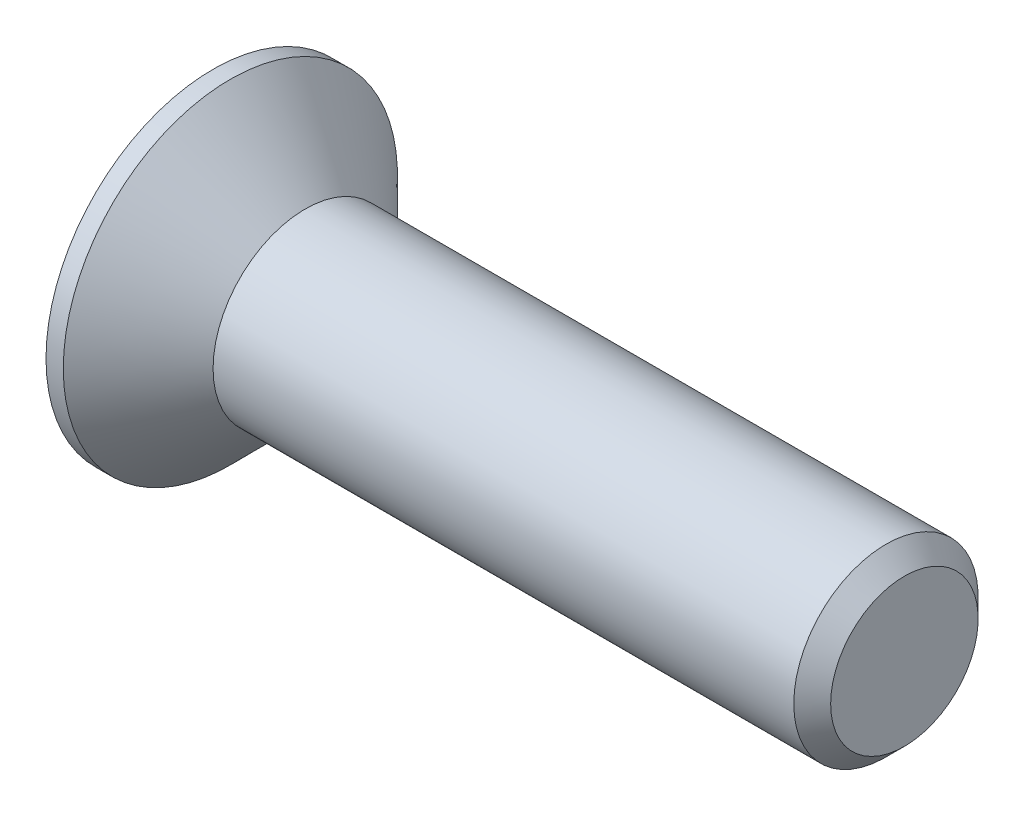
ISO-10303-21;
HEADER;
FILE_DESCRIPTION(('STEP AP214'),'2;1');
FILE_NAME('part.step','',(''),(''),'','','');
FILE_SCHEMA(('AUTOMOTIVE_DESIGN { 1 0 10303 214 1 1 1 1 }'));
ENDSEC;
DATA;
#1=APPLICATION_CONTEXT('core data for automotive mechanical design processes');
#2=APPLICATION_PROTOCOL_DEFINITION('international standard','automotive_design',2000,#1);
#3=PRODUCT_CONTEXT('',#1,'mechanical');
#4=PRODUCT('Part','Part','',(#3));
#5=PRODUCT_RELATED_PRODUCT_CATEGORY('part','',(#4));
#6=PRODUCT_DEFINITION_FORMATION('','',#4);
#7=PRODUCT_DEFINITION_CONTEXT('part definition',#1,'design');
#8=PRODUCT_DEFINITION('design','',#6,#7);
#9=PRODUCT_DEFINITION_SHAPE('','',#8);
#10=(LENGTH_UNIT() NAMED_UNIT(*) SI_UNIT(.MILLI.,.METRE.));
#11=(NAMED_UNIT(*) PLANE_ANGLE_UNIT() SI_UNIT($,.RADIAN.));
#12=(NAMED_UNIT(*) SI_UNIT($,.STERADIAN.) SOLID_ANGLE_UNIT());
#13=UNCERTAINTY_MEASURE_WITH_UNIT(LENGTH_MEASURE(1.E-05),#10,'distance_accuracy_value','');
#14=(GEOMETRIC_REPRESENTATION_CONTEXT(3) GLOBAL_UNCERTAINTY_ASSIGNED_CONTEXT((#13)) GLOBAL_UNIT_ASSIGNED_CONTEXT((#10,
#11,#12)) REPRESENTATION_CONTEXT('',''));
#15=CARTESIAN_POINT('',(0.,0.,0.));
#16=DIRECTION('',(0.,0.,1.));
#17=DIRECTION('',(1.,0.,0.));
#18=AXIS2_PLACEMENT_3D('',#15,#16,#17);
#19=CARTESIAN_POINT('',(0.,0.,0.));
#20=DIRECTION('',(-1.,0.,0.));
#21=DIRECTION('',(0.,0.,1.));
#22=AXIS2_PLACEMENT_3D('',#19,#20,#21);
#23=CONICAL_SURFACE('',#22,4.,0.78539816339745);
#24=CARTESIAN_POINT('',(-3.24999999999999,0.,0.));
#25=DIRECTION('',(-1.,0.,0.));
#26=DIRECTION('',(0.,0.,1.));
#27=AXIS2_PLACEMENT_3D('',#24,#25,#26);
#28=CIRCLE('',#27,7.25);
#29=CARTESIAN_POINT('',(-3.24999999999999,0.,7.25));
#30=VERTEX_POINT('',#29);
#31=EDGE_CURVE('E189',#30,#30,#28,.T.);
#32=ORIENTED_EDGE('',*,*,#31,.F.);
#33=EDGE_LOOP('',(#32));
#34=FACE_BOUND('',#33,.T.);
#35=CARTESIAN_POINT('',(0.,0.,0.));
#36=DIRECTION('',(-1.,0.,0.));
#37=DIRECTION('',(0.,0.,1.));
#38=AXIS2_PLACEMENT_3D('',#35,#36,#37);
#39=CIRCLE('',#38,4.);
#40=CARTESIAN_POINT('',(0.,0.,4.));
#41=VERTEX_POINT('',#40);
#42=EDGE_CURVE('E212',#41,#41,#39,.T.);
#43=ORIENTED_EDGE('',*,*,#42,.T.);
#44=EDGE_LOOP('',(#43));
#45=FACE_BOUND('',#44,.T.);
#46=ADVANCED_FACE('F33',(#34,#45),#23,.T.);
#47=CARTESIAN_POINT('',(-4.,0.,0.));
#48=DIRECTION('',(-1.,0.,0.));
#49=DIRECTION('',(0.,0.,1.));
#50=AXIS2_PLACEMENT_3D('',#47,#48,#49);
#51=CYLINDRICAL_SURFACE('',#50,4.);
#52=CARTESIAN_POINT('',(25.2,0.,0.));
#53=DIRECTION('',(-1.,0.,0.));
#54=DIRECTION('',(0.,0.,1.));
#55=AXIS2_PLACEMENT_3D('',#52,#53,#54);
#56=CIRCLE('',#55,4.);
#57=CARTESIAN_POINT('',(25.2,0.,4.));
#58=VERTEX_POINT('',#57);
#59=EDGE_CURVE('E41',#58,#58,#56,.T.);
#60=ORIENTED_EDGE('',*,*,#59,.T.);
#61=EDGE_LOOP('',(#60));
#62=FACE_BOUND('',#61,.T.);
#63=ORIENTED_EDGE('',*,*,#42,.F.);
#64=EDGE_LOOP('',(#63));
#65=FACE_BOUND('',#64,.T.);
#66=ADVANCED_FACE('F217',(#62,#65),#51,.T.);
#67=CARTESIAN_POINT('',(26.,0.,0.));
#68=DIRECTION('',(-1.,0.,0.));
#69=DIRECTION('',(0.,0.,1.));
#70=AXIS2_PLACEMENT_3D('',#67,#68,#69);
#71=PLANE('',#70);
#72=CARTESIAN_POINT('',(26.,0.,0.));
#73=DIRECTION('',(-1.,0.,0.));
#74=DIRECTION('',(0.,0.,1.));
#75=AXIS2_PLACEMENT_3D('',#72,#73,#74);
#76=CIRCLE('',#75,3.20000000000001);
#77=CARTESIAN_POINT('',(26.,0.,3.20000000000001));
#78=VERTEX_POINT('',#77);
#79=EDGE_CURVE('E11',#78,#78,#76,.F.);
#80=ORIENTED_EDGE('',*,*,#79,.T.);
#81=EDGE_LOOP('',(#80));
#82=FACE_BOUND('',#81,.T.);
#83=ADVANCED_FACE('F239',(#82),#71,.F.);
#84=CARTESIAN_POINT('',(-4.,7.25,0.));
#85=DIRECTION('',(1.,0.,0.));
#86=DIRECTION('',(0.,0.,-1.));
#87=AXIS2_PLACEMENT_3D('',#84,#85,#86);
#88=PLANE('',#87);
#89=DIRECTION('',(0.,0.,-1.));
#90=VECTOR('',#89,1.);
#91=CARTESIAN_POINT('',(-4.,1.09,-4.35));
#92=LINE('',#91,#90);
#93=CARTESIAN_POINT('',(-4.,1.09,-1.09));
#94=VERTEX_POINT('',#93);
#95=CARTESIAN_POINT('',(-4.,1.09,-4.35));
#96=VERTEX_POINT('',#95);
#97=EDGE_CURVE('E158',#94,#96,#92,.T.);
#98=ORIENTED_EDGE('',*,*,#97,.F.);
#99=DIRECTION('',(0.,-1.,0.));
#100=VECTOR('',#99,1.);
#101=CARTESIAN_POINT('',(-4.,1.09,-1.09));
#102=LINE('',#101,#100);
#103=CARTESIAN_POINT('',(-4.,4.35,-1.09));
#104=VERTEX_POINT('',#103);
#105=EDGE_CURVE('E48',#104,#94,#102,.T.);
#106=ORIENTED_EDGE('',*,*,#105,.F.);
#107=DIRECTION('',(0.,0.,-1.));
#108=VECTOR('',#107,1.);
#109=CARTESIAN_POINT('',(-4.,4.35,-1.09));
#110=LINE('',#109,#108);
#111=CARTESIAN_POINT('',(-4.,4.35,1.09));
#112=VERTEX_POINT('',#111);
#113=EDGE_CURVE('E185',#112,#104,#110,.T.);
#114=ORIENTED_EDGE('',*,*,#113,.F.);
#115=DIRECTION('',(0.,1.,0.));
#116=VECTOR('',#115,1.);
#117=CARTESIAN_POINT('',(-4.,4.35,1.09));
#118=LINE('',#117,#116);
#119=CARTESIAN_POINT('',(-4.,1.09,1.09));
#120=VERTEX_POINT('',#119);
#121=EDGE_CURVE('E183',#120,#112,#118,.T.);
#122=ORIENTED_EDGE('',*,*,#121,.F.);
#123=DIRECTION('',(0.,0.,-1.));
#124=VECTOR('',#123,1.);
#125=CARTESIAN_POINT('',(-4.,1.09,1.09));
#126=LINE('',#125,#124);
#127=CARTESIAN_POINT('',(-4.,1.09,4.35));
#128=VERTEX_POINT('',#127);
#129=EDGE_CURVE('E132',#128,#120,#126,.T.);
#130=ORIENTED_EDGE('',*,*,#129,.F.);
#131=DIRECTION('',(0.,1.,0.));
#132=VECTOR('',#131,1.);
#133=CARTESIAN_POINT('',(-4.,1.09,4.35));
#134=LINE('',#133,#132);
#135=CARTESIAN_POINT('',(-4.,-1.09,4.35));
#136=VERTEX_POINT('',#135);
#137=EDGE_CURVE('E179',#136,#128,#134,.T.);
#138=ORIENTED_EDGE('',*,*,#137,.F.);
#139=DIRECTION('',(0.,0.,1.));
#140=VECTOR('',#139,1.);
#141=CARTESIAN_POINT('',(-4.,-1.09,4.35));
#142=LINE('',#141,#140);
#143=CARTESIAN_POINT('',(-4.,-1.09,1.09));
#144=VERTEX_POINT('',#143);
#145=EDGE_CURVE('E176',#144,#136,#142,.T.);
#146=ORIENTED_EDGE('',*,*,#145,.F.);
#147=DIRECTION('',(0.,1.,0.));
#148=VECTOR('',#147,1.);
#149=CARTESIAN_POINT('',(-4.,-1.09,1.09));
#150=LINE('',#149,#148);
#151=CARTESIAN_POINT('',(-4.,-4.35,1.09));
#152=VERTEX_POINT('',#151);
#153=EDGE_CURVE('E173',#152,#144,#150,.T.);
#154=ORIENTED_EDGE('',*,*,#153,.F.);
#155=DIRECTION('',(0.,0.,1.));
#156=VECTOR('',#155,1.);
#157=CARTESIAN_POINT('',(-4.,-4.35,1.09));
#158=LINE('',#157,#156);
#159=CARTESIAN_POINT('',(-4.,-4.35,-1.09));
#160=VERTEX_POINT('',#159);
#161=EDGE_CURVE('E170',#160,#152,#158,.T.);
#162=ORIENTED_EDGE('',*,*,#161,.F.);
#163=DIRECTION('',(0.,-1.,0.));
#164=VECTOR('',#163,1.);
#165=CARTESIAN_POINT('',(-4.,-4.35,-1.09));
#166=LINE('',#165,#164);
#167=CARTESIAN_POINT('',(-4.,-1.09,-1.09));
#168=VERTEX_POINT('',#167);
#169=EDGE_CURVE('E167',#168,#160,#166,.T.);
#170=ORIENTED_EDGE('',*,*,#169,.F.);
#171=DIRECTION('',(0.,0.,1.));
#172=VECTOR('',#171,1.);
#173=CARTESIAN_POINT('',(-4.,-1.09,-1.09));
#174=LINE('',#173,#172);
#175=CARTESIAN_POINT('',(-4.,-1.09,-4.35));
#176=VERTEX_POINT('',#175);
#177=EDGE_CURVE('E164',#176,#168,#174,.T.);
#178=ORIENTED_EDGE('',*,*,#177,.F.);
#179=DIRECTION('',(0.,-1.,0.));
#180=VECTOR('',#179,1.);
#181=CARTESIAN_POINT('',(-4.,-1.09,-4.35));
#182=LINE('',#181,#180);
#183=EDGE_CURVE('E161',#96,#176,#182,.T.);
#184=ORIENTED_EDGE('',*,*,#183,.F.);
#185=EDGE_LOOP('',(#98,#106,#114,#122,#130,#138,#146,#154,#162,#170,#178,#184));
#186=FACE_BOUND('',#185,.T.);
#187=CARTESIAN_POINT('',(-4.,0.,0.));
#188=DIRECTION('',(-1.,0.,0.));
#189=DIRECTION('',(0.,0.,1.));
#190=AXIS2_PLACEMENT_3D('',#187,#188,#189);
#191=CIRCLE('',#190,7.25);
#192=CARTESIAN_POINT('',(-4.,0.,7.25));
#193=VERTEX_POINT('',#192);
#194=EDGE_CURVE('E209',#193,#193,#191,.T.);
#195=ORIENTED_EDGE('',*,*,#194,.T.);
#196=EDGE_LOOP('',(#195));
#197=FACE_BOUND('',#196,.T.);
#198=ADVANCED_FACE('F230',(#186,#197),#88,.F.);
#199=CARTESIAN_POINT('',(-4.,0.,0.));
#200=DIRECTION('',(-1.,0.,0.));
#201=DIRECTION('',(0.,0.,1.));
#202=AXIS2_PLACEMENT_3D('',#199,#200,#201);
#203=CYLINDRICAL_SURFACE('',#202,7.25);
#204=ORIENTED_EDGE('',*,*,#194,.F.);
#205=EDGE_LOOP('',(#204));
#206=FACE_BOUND('',#205,.T.);
#207=ORIENTED_EDGE('',*,*,#31,.T.);
#208=EDGE_LOOP('',(#207));
#209=FACE_BOUND('',#208,.T.);
#210=ADVANCED_FACE('F222',(#206,#209),#203,.T.);
#211=CARTESIAN_POINT('',(25.2,0.,0.));
#212=DIRECTION('',(-1.,0.,0.));
#213=DIRECTION('',(0.,0.,1.));
#214=AXIS2_PLACEMENT_3D('',#211,#212,#213);
#215=CONICAL_SURFACE('',#214,4.,0.785398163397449);
#216=ORIENTED_EDGE('',*,*,#79,.F.);
#217=EDGE_LOOP('',(#216));
#218=FACE_BOUND('',#217,.T.);
#219=ORIENTED_EDGE('',*,*,#59,.F.);
#220=EDGE_LOOP('',(#219));
#221=FACE_BOUND('',#220,.T.);
#222=ADVANCED_FACE('F35',(#218,#221),#215,.T.);
#223=CARTESIAN_POINT('',(-0.55,1.09,-1.09));
#224=DIRECTION('',(0.,0.,-1.));
#225=DIRECTION('',(-1.,0.,0.));
#226=AXIS2_PLACEMENT_3D('',#223,#224,#225);
#227=PLANE('',#226);
#228=ORIENTED_EDGE('',*,*,#105,.T.);
#229=DIRECTION('',(-1.,0.,0.));
#230=VECTOR('',#229,1.);
#231=CARTESIAN_POINT('',(-0.55,1.09,-1.09));
#232=LINE('',#231,#230);
#233=CARTESIAN_POINT('',(-0.55,1.09,-1.09));
#234=VERTEX_POINT('',#233);
#235=EDGE_CURVE('E96',#234,#94,#232,.T.);
#236=ORIENTED_EDGE('',*,*,#235,.F.);
#237=DIRECTION('',(0.,-1.,0.));
#238=VECTOR('',#237,1.);
#239=CARTESIAN_POINT('',(-0.55,1.09,-1.09));
#240=LINE('',#239,#238);
#241=CARTESIAN_POINT('',(-0.55,4.35,-1.09));
#242=VERTEX_POINT('',#241);
#243=EDGE_CURVE('E187',#242,#234,#240,.T.);
#244=ORIENTED_EDGE('',*,*,#243,.F.);
#245=DIRECTION('',(-1.,0.,0.));
#246=VECTOR('',#245,1.);
#247=CARTESIAN_POINT('',(-0.55,4.35,-1.09));
#248=LINE('',#247,#246);
#249=EDGE_CURVE('E56',#242,#104,#248,.T.);
#250=ORIENTED_EDGE('',*,*,#249,.T.);
#251=EDGE_LOOP('',(#228,#236,#244,#250));
#252=FACE_BOUND('',#251,.T.);
#253=ADVANCED_FACE('F221',(#252),#227,.F.);
#254=CARTESIAN_POINT('',(-0.55,4.35,-1.09));
#255=DIRECTION('',(0.,1.,0.));
#256=DIRECTION('',(-1.,0.,0.));
#257=AXIS2_PLACEMENT_3D('',#254,#255,#256);
#258=PLANE('',#257);
#259=ORIENTED_EDGE('',*,*,#113,.T.);
#260=ORIENTED_EDGE('',*,*,#249,.F.);
#261=DIRECTION('',(0.,0.,-1.));
#262=VECTOR('',#261,1.);
#263=CARTESIAN_POINT('',(-0.55,4.35,-1.09));
#264=LINE('',#263,#262);
#265=CARTESIAN_POINT('',(-0.55,4.35,1.09));
#266=VERTEX_POINT('',#265);
#267=EDGE_CURVE('E144',#266,#242,#264,.T.);
#268=ORIENTED_EDGE('',*,*,#267,.F.);
#269=DIRECTION('',(-1.,0.,0.));
#270=VECTOR('',#269,1.);
#271=CARTESIAN_POINT('',(-0.55,4.35,1.09));
#272=LINE('',#271,#270);
#273=EDGE_CURVE('E136',#266,#112,#272,.T.);
#274=ORIENTED_EDGE('',*,*,#273,.T.);
#275=EDGE_LOOP('',(#259,#260,#268,#274));
#276=FACE_BOUND('',#275,.T.);
#277=ADVANCED_FACE('F228',(#276),#258,.F.);
#278=CARTESIAN_POINT('',(-0.55,4.35,1.09));
#279=DIRECTION('',(0.,0.,1.));
#280=DIRECTION('',(1.,0.,0.));
#281=AXIS2_PLACEMENT_3D('',#278,#279,#280);
#282=PLANE('',#281);
#283=ORIENTED_EDGE('',*,*,#121,.T.);
#284=ORIENTED_EDGE('',*,*,#273,.F.);
#285=DIRECTION('',(0.,1.,0.));
#286=VECTOR('',#285,1.);
#287=CARTESIAN_POINT('',(-0.55,4.35,1.09));
#288=LINE('',#287,#286);
#289=CARTESIAN_POINT('',(-0.55,1.09,1.09));
#290=VERTEX_POINT('',#289);
#291=EDGE_CURVE('E140',#290,#266,#288,.T.);
#292=ORIENTED_EDGE('',*,*,#291,.F.);
#293=DIRECTION('',(-1.,0.,0.));
#294=VECTOR('',#293,1.);
#295=CARTESIAN_POINT('',(-0.55,1.09,1.09));
#296=LINE('',#295,#294);
#297=EDGE_CURVE('E125',#290,#120,#296,.T.);
#298=ORIENTED_EDGE('',*,*,#297,.T.);
#299=EDGE_LOOP('',(#283,#284,#292,#298));
#300=FACE_BOUND('',#299,.T.);
#301=ADVANCED_FACE('F141',(#300),#282,.F.);
#302=CARTESIAN_POINT('',(-0.55,1.09,1.09));
#303=DIRECTION('',(0.,1.,0.));
#304=DIRECTION('',(-1.,0.,0.));
#305=AXIS2_PLACEMENT_3D('',#302,#303,#304);
#306=PLANE('',#305);
#307=ORIENTED_EDGE('',*,*,#129,.T.);
#308=ORIENTED_EDGE('',*,*,#297,.F.);
#309=DIRECTION('',(0.,0.,-1.));
#310=VECTOR('',#309,1.);
#311=CARTESIAN_POINT('',(-0.55,1.09,1.09));
#312=LINE('',#311,#310);
#313=CARTESIAN_POINT('',(-0.55,1.09,4.35));
#314=VERTEX_POINT('',#313);
#315=EDGE_CURVE('E129',#314,#290,#312,.T.);
#316=ORIENTED_EDGE('',*,*,#315,.F.);
#317=DIRECTION('',(-1.,0.,0.));
#318=VECTOR('',#317,1.);
#319=CARTESIAN_POINT('',(-0.55,1.09,4.35));
#320=LINE('',#319,#318);
#321=EDGE_CURVE('E137',#314,#128,#320,.T.);
#322=ORIENTED_EDGE('',*,*,#321,.T.);
#323=EDGE_LOOP('',(#307,#308,#316,#322));
#324=FACE_BOUND('',#323,.T.);
#325=ADVANCED_FACE('F127',(#324),#306,.F.);
#326=CARTESIAN_POINT('',(-0.55,1.09,4.35));
#327=DIRECTION('',(0.,0.,1.));
#328=DIRECTION('',(1.,0.,0.));
#329=AXIS2_PLACEMENT_3D('',#326,#327,#328);
#330=PLANE('',#329);
#331=ORIENTED_EDGE('',*,*,#137,.T.);
#332=ORIENTED_EDGE('',*,*,#321,.F.);
#333=DIRECTION('',(0.,1.,0.));
#334=VECTOR('',#333,1.);
#335=CARTESIAN_POINT('',(-0.55,1.09,4.35));
#336=LINE('',#335,#334);
#337=CARTESIAN_POINT('',(-0.55,-1.09,4.35));
#338=VERTEX_POINT('',#337);
#339=EDGE_CURVE('E150',#338,#314,#336,.T.);
#340=ORIENTED_EDGE('',*,*,#339,.F.);
#341=DIRECTION('',(-1.,0.,0.));
#342=VECTOR('',#341,1.);
#343=CARTESIAN_POINT('',(-0.55,-1.09,4.35));
#344=LINE('',#343,#342);
#345=EDGE_CURVE('E192',#338,#136,#344,.T.);
#346=ORIENTED_EDGE('',*,*,#345,.T.);
#347=EDGE_LOOP('',(#331,#332,#340,#346));
#348=FACE_BOUND('',#347,.T.);
#349=ADVANCED_FACE('F277',(#348),#330,.F.);
#350=CARTESIAN_POINT('',(-0.55,-1.09,4.35));
#351=DIRECTION('',(0.,-1.,0.));
#352=DIRECTION('',(1.,0.,0.));
#353=AXIS2_PLACEMENT_3D('',#350,#351,#352);
#354=PLANE('',#353);
#355=ORIENTED_EDGE('',*,*,#145,.T.);
#356=ORIENTED_EDGE('',*,*,#345,.F.);
#357=DIRECTION('',(0.,0.,1.));
#358=VECTOR('',#357,1.);
#359=CARTESIAN_POINT('',(-0.55,-1.09,4.35));
#360=LINE('',#359,#358);
#361=CARTESIAN_POINT('',(-0.55,-1.09,1.09));
#362=VERTEX_POINT('',#361);
#363=EDGE_CURVE('E152',#362,#338,#360,.T.);
#364=ORIENTED_EDGE('',*,*,#363,.F.);
#365=DIRECTION('',(-1.,0.,0.));
#366=VECTOR('',#365,1.);
#367=CARTESIAN_POINT('',(-0.55,-1.09,1.09));
#368=LINE('',#367,#366);
#369=EDGE_CURVE('E194',#362,#144,#368,.T.);
#370=ORIENTED_EDGE('',*,*,#369,.T.);
#371=EDGE_LOOP('',(#355,#356,#364,#370));
#372=FACE_BOUND('',#371,.T.);
#373=ADVANCED_FACE('F273',(#372),#354,.F.);
#374=CARTESIAN_POINT('',(-0.55,-1.09,1.09));
#375=DIRECTION('',(0.,0.,1.));
#376=DIRECTION('',(1.,0.,0.));
#377=AXIS2_PLACEMENT_3D('',#374,#375,#376);
#378=PLANE('',#377);
#379=ORIENTED_EDGE('',*,*,#153,.T.);
#380=ORIENTED_EDGE('',*,*,#369,.F.);
#381=DIRECTION('',(0.,1.,0.));
#382=VECTOR('',#381,1.);
#383=CARTESIAN_POINT('',(-0.55,-1.09,1.09));
#384=LINE('',#383,#382);
#385=CARTESIAN_POINT('',(-0.55,-4.35,1.09));
#386=VERTEX_POINT('',#385);
#387=EDGE_CURVE('E422',#386,#362,#384,.T.);
#388=ORIENTED_EDGE('',*,*,#387,.F.);
#389=DIRECTION('',(-1.,0.,0.));
#390=VECTOR('',#389,1.);
#391=CARTESIAN_POINT('',(-0.55,-4.35,1.09));
#392=LINE('',#391,#390);
#393=EDGE_CURVE('E196',#386,#152,#392,.T.);
#394=ORIENTED_EDGE('',*,*,#393,.T.);
#395=EDGE_LOOP('',(#379,#380,#388,#394));
#396=FACE_BOUND('',#395,.T.);
#397=ADVANCED_FACE('F269',(#396),#378,.F.);
#398=CARTESIAN_POINT('',(-0.55,-4.35,1.09));
#399=DIRECTION('',(0.,-1.,0.));
#400=DIRECTION('',(1.,0.,0.));
#401=AXIS2_PLACEMENT_3D('',#398,#399,#400);
#402=PLANE('',#401);
#403=ORIENTED_EDGE('',*,*,#161,.T.);
#404=ORIENTED_EDGE('',*,*,#393,.F.);
#405=DIRECTION('',(0.,0.,1.));
#406=VECTOR('',#405,1.);
#407=CARTESIAN_POINT('',(-0.55,-4.35,1.09));
#408=LINE('',#407,#406);
#409=CARTESIAN_POINT('',(-0.55,-4.35,-1.09));
#410=VERTEX_POINT('',#409);
#411=EDGE_CURVE('E419',#410,#386,#408,.T.);
#412=ORIENTED_EDGE('',*,*,#411,.F.);
#413=DIRECTION('',(-1.,0.,0.));
#414=VECTOR('',#413,1.);
#415=CARTESIAN_POINT('',(-0.55,-4.35,-1.09));
#416=LINE('',#415,#414);
#417=EDGE_CURVE('E198',#410,#160,#416,.T.);
#418=ORIENTED_EDGE('',*,*,#417,.T.);
#419=EDGE_LOOP('',(#403,#404,#412,#418));
#420=FACE_BOUND('',#419,.T.);
#421=ADVANCED_FACE('F265',(#420),#402,.F.);
#422=CARTESIAN_POINT('',(-0.55,-4.35,-1.09));
#423=DIRECTION('',(0.,0.,-1.));
#424=DIRECTION('',(-1.,0.,0.));
#425=AXIS2_PLACEMENT_3D('',#422,#423,#424);
#426=PLANE('',#425);
#427=ORIENTED_EDGE('',*,*,#169,.T.);
#428=ORIENTED_EDGE('',*,*,#417,.F.);
#429=DIRECTION('',(0.,-1.,0.));
#430=VECTOR('',#429,1.);
#431=CARTESIAN_POINT('',(-0.55,-4.35,-1.09));
#432=LINE('',#431,#430);
#433=CARTESIAN_POINT('',(-0.55,-1.09,-1.09));
#434=VERTEX_POINT('',#433);
#435=EDGE_CURVE('E416',#434,#410,#432,.T.);
#436=ORIENTED_EDGE('',*,*,#435,.F.);
#437=DIRECTION('',(-1.,0.,0.));
#438=VECTOR('',#437,1.);
#439=CARTESIAN_POINT('',(-0.55,-1.09,-1.09));
#440=LINE('',#439,#438);
#441=EDGE_CURVE('E200',#434,#168,#440,.T.);
#442=ORIENTED_EDGE('',*,*,#441,.T.);
#443=EDGE_LOOP('',(#427,#428,#436,#442));
#444=FACE_BOUND('',#443,.T.);
#445=ADVANCED_FACE('F261',(#444),#426,.F.);
#446=CARTESIAN_POINT('',(-0.55,-1.09,-1.09));
#447=DIRECTION('',(0.,-1.,0.));
#448=DIRECTION('',(1.,0.,0.));
#449=AXIS2_PLACEMENT_3D('',#446,#447,#448);
#450=PLANE('',#449);
#451=ORIENTED_EDGE('',*,*,#177,.T.);
#452=ORIENTED_EDGE('',*,*,#441,.F.);
#453=DIRECTION('',(0.,0.,1.));
#454=VECTOR('',#453,1.);
#455=CARTESIAN_POINT('',(-0.55,-1.09,-1.09));
#456=LINE('',#455,#454);
#457=CARTESIAN_POINT('',(-0.55,-1.09,-4.35));
#458=VERTEX_POINT('',#457);
#459=EDGE_CURVE('E413',#458,#434,#456,.T.);
#460=ORIENTED_EDGE('',*,*,#459,.F.);
#461=DIRECTION('',(-1.,0.,0.));
#462=VECTOR('',#461,1.);
#463=CARTESIAN_POINT('',(-0.55,-1.09,-4.35));
#464=LINE('',#463,#462);
#465=EDGE_CURVE('E202',#458,#176,#464,.T.);
#466=ORIENTED_EDGE('',*,*,#465,.T.);
#467=EDGE_LOOP('',(#451,#452,#460,#466));
#468=FACE_BOUND('',#467,.T.);
#469=ADVANCED_FACE('F257',(#468),#450,.F.);
#470=CARTESIAN_POINT('',(-0.55,-1.09,-4.35));
#471=DIRECTION('',(0.,0.,-1.));
#472=DIRECTION('',(-1.,0.,0.));
#473=AXIS2_PLACEMENT_3D('',#470,#471,#472);
#474=PLANE('',#473);
#475=ORIENTED_EDGE('',*,*,#183,.T.);
#476=ORIENTED_EDGE('',*,*,#465,.F.);
#477=DIRECTION('',(0.,-1.,0.));
#478=VECTOR('',#477,1.);
#479=CARTESIAN_POINT('',(-0.55,-1.09,-4.35));
#480=LINE('',#479,#478);
#481=CARTESIAN_POINT('',(-0.55,1.09,-4.35));
#482=VERTEX_POINT('',#481);
#483=EDGE_CURVE('E408',#482,#458,#480,.T.);
#484=ORIENTED_EDGE('',*,*,#483,.F.);
#485=DIRECTION('',(-1.,0.,0.));
#486=VECTOR('',#485,1.);
#487=CARTESIAN_POINT('',(-0.55,1.09,-4.35));
#488=LINE('',#487,#486);
#489=EDGE_CURVE('E204',#482,#96,#488,.T.);
#490=ORIENTED_EDGE('',*,*,#489,.T.);
#491=EDGE_LOOP('',(#475,#476,#484,#490));
#492=FACE_BOUND('',#491,.T.);
#493=ADVANCED_FACE('F253',(#492),#474,.F.);
#494=CARTESIAN_POINT('',(-0.55,1.09,-4.35));
#495=DIRECTION('',(0.,1.,0.));
#496=DIRECTION('',(-1.,0.,0.));
#497=AXIS2_PLACEMENT_3D('',#494,#495,#496);
#498=PLANE('',#497);
#499=ORIENTED_EDGE('',*,*,#97,.T.);
#500=ORIENTED_EDGE('',*,*,#489,.F.);
#501=DIRECTION('',(0.,0.,-1.));
#502=VECTOR('',#501,1.);
#503=CARTESIAN_POINT('',(-0.55,1.09,-4.35));
#504=LINE('',#503,#502);
#505=EDGE_CURVE('E406',#234,#482,#504,.T.);
#506=ORIENTED_EDGE('',*,*,#505,.F.);
#507=ORIENTED_EDGE('',*,*,#235,.T.);
#508=EDGE_LOOP('',(#499,#500,#506,#507));
#509=FACE_BOUND('',#508,.T.);
#510=ADVANCED_FACE('F250',(#509),#498,.F.);
#511=CARTESIAN_POINT('',(-0.55,0.,0.));
#512=DIRECTION('',(1.,0.,0.));
#513=DIRECTION('',(0.,0.,-1.));
#514=AXIS2_PLACEMENT_3D('',#511,#512,#513);
#515=PLANE('',#514);
#516=ORIENTED_EDGE('',*,*,#243,.T.);
#517=ORIENTED_EDGE('',*,*,#505,.T.);
#518=ORIENTED_EDGE('',*,*,#483,.T.);
#519=ORIENTED_EDGE('',*,*,#459,.T.);
#520=ORIENTED_EDGE('',*,*,#435,.T.);
#521=ORIENTED_EDGE('',*,*,#411,.T.);
#522=ORIENTED_EDGE('',*,*,#387,.T.);
#523=ORIENTED_EDGE('',*,*,#363,.T.);
#524=ORIENTED_EDGE('',*,*,#339,.T.);
#525=ORIENTED_EDGE('',*,*,#315,.T.);
#526=ORIENTED_EDGE('',*,*,#291,.T.);
#527=ORIENTED_EDGE('',*,*,#267,.T.);
#528=EDGE_LOOP('',(#516,#517,#518,#519,#520,#521,#522,#523,#524,#525,#526,#527));
#529=FACE_BOUND('',#528,.T.);
#530=ADVANCED_FACE('F147',(#529),#515,.F.);
#531=CLOSED_SHELL('',(#46,#66,#83,#198,#210,#222,#253,#277,#301,#325,#349,#373,#397,#421,#445,
#469,#493,#510,#530));
#532=MANIFOLD_SOLID_BREP('B2',#531);
#533=ADVANCED_BREP_SHAPE_REPRESENTATION('',(#18,#532),#14);
#534=SHAPE_DEFINITION_REPRESENTATION(#9,#533);
ENDSEC;
END-ISO-10303-21;
